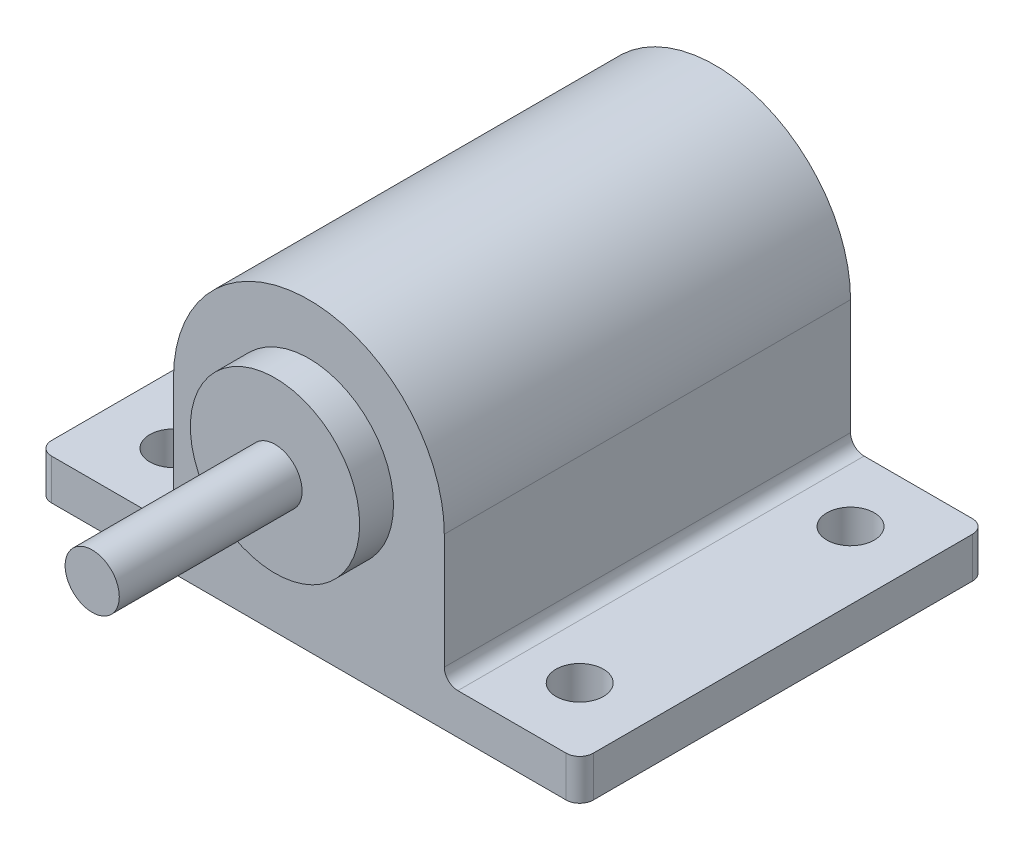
ISO-10303-21;
HEADER;
FILE_DESCRIPTION(('STEP AP214'),'2;1');
FILE_NAME('part.step','',(''),(''),'','','');
FILE_SCHEMA(('AUTOMOTIVE_DESIGN { 1 0 10303 214 1 1 1 1 }'));
ENDSEC;
DATA;
#1=APPLICATION_CONTEXT('core data for automotive mechanical design processes');
#2=APPLICATION_PROTOCOL_DEFINITION('international standard','automotive_design',2000,#1);
#3=PRODUCT_CONTEXT('',#1,'mechanical');
#4=PRODUCT('Part','Part','',(#3));
#5=PRODUCT_RELATED_PRODUCT_CATEGORY('part','',(#4));
#6=PRODUCT_DEFINITION_FORMATION('','',#4);
#7=PRODUCT_DEFINITION_CONTEXT('part definition',#1,'design');
#8=PRODUCT_DEFINITION('design','',#6,#7);
#9=PRODUCT_DEFINITION_SHAPE('','',#8);
#10=(LENGTH_UNIT() NAMED_UNIT(*) SI_UNIT(.MILLI.,.METRE.));
#11=(NAMED_UNIT(*) PLANE_ANGLE_UNIT() SI_UNIT($,.RADIAN.));
#12=(NAMED_UNIT(*) SI_UNIT($,.STERADIAN.) SOLID_ANGLE_UNIT());
#13=UNCERTAINTY_MEASURE_WITH_UNIT(LENGTH_MEASURE(1.E-05),#10,'distance_accuracy_value','');
#14=(GEOMETRIC_REPRESENTATION_CONTEXT(3) GLOBAL_UNCERTAINTY_ASSIGNED_CONTEXT((#13)) GLOBAL_UNIT_ASSIGNED_CONTEXT((#10,
#11,#12)) REPRESENTATION_CONTEXT('',''));
#15=CARTESIAN_POINT('',(0.,0.,0.));
#16=DIRECTION('',(0.,0.,1.));
#17=DIRECTION('',(1.,0.,0.));
#18=AXIS2_PLACEMENT_3D('',#15,#16,#17);
#19=CARTESIAN_POINT('',(-40.,0.,30.));
#20=DIRECTION('',(0.,1.,0.));
#21=DIRECTION('',(0.,0.,1.));
#22=AXIS2_PLACEMENT_3D('',#19,#20,#21);
#23=PLANE('',#22);
#24=CARTESIAN_POINT('',(30.,0.,-20.));
#25=DIRECTION('',(0.,1.,0.));
#26=DIRECTION('',(0.,0.,1.));
#27=AXIS2_PLACEMENT_3D('',#24,#25,#26);
#28=CIRCLE('',#27,3.5);
#29=CARTESIAN_POINT('',(30.,0.,-16.5));
#30=VERTEX_POINT('',#29);
#31=EDGE_CURVE('E180',#30,#30,#28,.T.);
#32=ORIENTED_EDGE('',*,*,#31,.T.);
#33=EDGE_LOOP('',(#32));
#34=FACE_BOUND('',#33,.T.);
#35=CARTESIAN_POINT('',(-30.,0.,20.));
#36=DIRECTION('',(0.,1.,0.));
#37=DIRECTION('',(0.,0.,1.));
#38=AXIS2_PLACEMENT_3D('',#35,#36,#37);
#39=CIRCLE('',#38,3.5);
#40=CARTESIAN_POINT('',(-30.,0.,23.5));
#41=VERTEX_POINT('',#40);
#42=EDGE_CURVE('E175',#41,#41,#39,.T.);
#43=ORIENTED_EDGE('',*,*,#42,.T.);
#44=EDGE_LOOP('',(#43));
#45=FACE_BOUND('',#44,.T.);
#46=DIRECTION('',(0.,0.,1.));
#47=VECTOR('',#46,1.);
#48=CARTESIAN_POINT('',(-40.,0.,-30.));
#49=LINE('',#48,#47);
#50=CARTESIAN_POINT('',(-40.,0.,-28.));
#51=VERTEX_POINT('',#50);
#52=CARTESIAN_POINT('',(-40.,0.,28.));
#53=VERTEX_POINT('',#52);
#54=EDGE_CURVE('E248',#51,#53,#49,.T.);
#55=ORIENTED_EDGE('',*,*,#54,.F.);
#56=CARTESIAN_POINT('',(-38.,0.,-28.));
#57=DIRECTION('',(0.,1.,0.));
#58=DIRECTION('',(0.,0.,1.));
#59=AXIS2_PLACEMENT_3D('',#56,#57,#58);
#60=CIRCLE('',#59,2.);
#61=CARTESIAN_POINT('',(-38.,0.,-30.));
#62=VERTEX_POINT('',#61);
#63=EDGE_CURVE('E211',#51,#62,#60,.F.);
#64=ORIENTED_EDGE('',*,*,#63,.T.);
#65=DIRECTION('',(-1.,0.,0.));
#66=VECTOR('',#65,1.);
#67=CARTESIAN_POINT('',(-40.,0.,-30.));
#68=LINE('',#67,#66);
#69=CARTESIAN_POINT('',(38.,0.,-30.));
#70=VERTEX_POINT('',#69);
#71=EDGE_CURVE('E242',#70,#62,#68,.T.);
#72=ORIENTED_EDGE('',*,*,#71,.F.);
#73=CARTESIAN_POINT('',(38.,0.,-28.));
#74=DIRECTION('',(0.,1.,0.));
#75=DIRECTION('',(0.,0.,1.));
#76=AXIS2_PLACEMENT_3D('',#73,#74,#75);
#77=CIRCLE('',#76,2.);
#78=CARTESIAN_POINT('',(40.,0.,-28.));
#79=VERTEX_POINT('',#78);
#80=EDGE_CURVE('E207',#70,#79,#77,.F.);
#81=ORIENTED_EDGE('',*,*,#80,.T.);
#82=DIRECTION('',(0.,0.,-1.));
#83=VECTOR('',#82,1.);
#84=CARTESIAN_POINT('',(40.,0.,-30.));
#85=LINE('',#84,#83);
#86=CARTESIAN_POINT('',(40.,0.,28.));
#87=VERTEX_POINT('',#86);
#88=EDGE_CURVE('E233',#87,#79,#85,.T.);
#89=ORIENTED_EDGE('',*,*,#88,.F.);
#90=CARTESIAN_POINT('',(38.,0.,28.));
#91=DIRECTION('',(0.,1.,0.));
#92=DIRECTION('',(0.,0.,1.));
#93=AXIS2_PLACEMENT_3D('',#90,#91,#92);
#94=CIRCLE('',#93,2.);
#95=CARTESIAN_POINT('',(38.,0.,30.));
#96=VERTEX_POINT('',#95);
#97=EDGE_CURVE('E205',#87,#96,#94,.F.);
#98=ORIENTED_EDGE('',*,*,#97,.T.);
#99=DIRECTION('',(1.,0.,0.));
#100=VECTOR('',#99,1.);
#101=CARTESIAN_POINT('',(-40.,0.,30.));
#102=LINE('',#101,#100);
#103=CARTESIAN_POINT('',(-38.,0.,30.));
#104=VERTEX_POINT('',#103);
#105=EDGE_CURVE('E243',#104,#96,#102,.T.);
#106=ORIENTED_EDGE('',*,*,#105,.F.);
#107=CARTESIAN_POINT('',(-38.,0.,28.));
#108=DIRECTION('',(0.,1.,0.));
#109=DIRECTION('',(0.,0.,1.));
#110=AXIS2_PLACEMENT_3D('',#107,#108,#109);
#111=CIRCLE('',#110,2.);
#112=EDGE_CURVE('E209',#104,#53,#111,.F.);
#113=ORIENTED_EDGE('',*,*,#112,.T.);
#114=EDGE_LOOP('',(#55,#64,#72,#81,#89,#98,#106,#113));
#115=FACE_BOUND('',#114,.T.);
#116=CARTESIAN_POINT('',(30.,0.,20.));
#117=DIRECTION('',(0.,1.,0.));
#118=DIRECTION('',(0.,0.,1.));
#119=AXIS2_PLACEMENT_3D('',#116,#117,#118);
#120=CIRCLE('',#119,3.5);
#121=CARTESIAN_POINT('',(30.,0.,23.5));
#122=VERTEX_POINT('',#121);
#123=EDGE_CURVE('E176',#122,#122,#120,.T.);
#124=ORIENTED_EDGE('',*,*,#123,.T.);
#125=EDGE_LOOP('',(#124));
#126=FACE_BOUND('',#125,.T.);
#127=CARTESIAN_POINT('',(-30.,0.,-20.));
#128=DIRECTION('',(0.,1.,0.));
#129=DIRECTION('',(0.,0.,1.));
#130=AXIS2_PLACEMENT_3D('',#127,#128,#129);
#131=CIRCLE('',#130,3.5);
#132=CARTESIAN_POINT('',(-30.,0.,-16.5));
#133=VERTEX_POINT('',#132);
#134=EDGE_CURVE('E183',#133,#133,#131,.T.);
#135=ORIENTED_EDGE('',*,*,#134,.T.);
#136=EDGE_LOOP('',(#135));
#137=FACE_BOUND('',#136,.T.);
#138=ADVANCED_FACE('F30',(#34,#45,#115,#126,#137),#23,.F.);
#139=CARTESIAN_POINT('',(-40.,6.,30.));
#140=DIRECTION('',(0.,1.,0.));
#141=DIRECTION('',(0.,0.,1.));
#142=AXIS2_PLACEMENT_3D('',#139,#140,#141);
#143=PLANE('',#142);
#144=CARTESIAN_POINT('',(-30.,6.,20.));
#145=DIRECTION('',(0.,1.,0.));
#146=DIRECTION('',(0.,0.,1.));
#147=AXIS2_PLACEMENT_3D('',#144,#145,#146);
#148=CIRCLE('',#147,3.5);
#149=CARTESIAN_POINT('',(-30.,6.,23.5));
#150=VERTEX_POINT('',#149);
#151=EDGE_CURVE('E512',#150,#150,#148,.F.);
#152=ORIENTED_EDGE('',*,*,#151,.T.);
#153=EDGE_LOOP('',(#152));
#154=FACE_BOUND('',#153,.T.);
#155=DIRECTION('',(-1.,0.,0.));
#156=VECTOR('',#155,1.);
#157=CARTESIAN_POINT('',(-40.,6.,-30.));
#158=LINE('',#157,#156);
#159=CARTESIAN_POINT('',(-22.,6.,-30.));
#160=VERTEX_POINT('',#159);
#161=CARTESIAN_POINT('',(-38.,6.,-30.));
#162=VERTEX_POINT('',#161);
#163=EDGE_CURVE('E528',#160,#162,#158,.T.);
#164=ORIENTED_EDGE('',*,*,#163,.T.);
#165=CARTESIAN_POINT('',(-38.,6.,-28.));
#166=DIRECTION('',(0.,1.,0.));
#167=DIRECTION('',(0.,0.,1.));
#168=AXIS2_PLACEMENT_3D('',#165,#166,#167);
#169=CIRCLE('',#168,2.);
#170=CARTESIAN_POINT('',(-40.,6.,-28.));
#171=VERTEX_POINT('',#170);
#172=EDGE_CURVE('E220',#162,#171,#169,.T.);
#173=ORIENTED_EDGE('',*,*,#172,.T.);
#174=DIRECTION('',(0.,0.,1.));
#175=VECTOR('',#174,1.);
#176=CARTESIAN_POINT('',(-40.,6.,-30.));
#177=LINE('',#176,#175);
#178=CARTESIAN_POINT('',(-40.,6.,28.));
#179=VERTEX_POINT('',#178);
#180=EDGE_CURVE('E246',#171,#179,#177,.T.);
#181=ORIENTED_EDGE('',*,*,#180,.T.);
#182=CARTESIAN_POINT('',(-38.,6.,28.));
#183=DIRECTION('',(0.,1.,0.));
#184=DIRECTION('',(0.,0.,1.));
#185=AXIS2_PLACEMENT_3D('',#182,#183,#184);
#186=CIRCLE('',#185,2.);
#187=CARTESIAN_POINT('',(-38.,6.,30.));
#188=VERTEX_POINT('',#187);
#189=EDGE_CURVE('E218',#179,#188,#186,.T.);
#190=ORIENTED_EDGE('',*,*,#189,.T.);
#191=DIRECTION('',(1.,0.,0.));
#192=VECTOR('',#191,1.);
#193=CARTESIAN_POINT('',(-40.,6.,30.));
#194=LINE('',#193,#192);
#195=CARTESIAN_POINT('',(-22.,6.,30.));
#196=VERTEX_POINT('',#195);
#197=EDGE_CURVE('E525',#188,#196,#194,.T.);
#198=ORIENTED_EDGE('',*,*,#197,.T.);
#199=DIRECTION('',(0.,0.,-1.));
#200=VECTOR('',#199,1.);
#201=CARTESIAN_POINT('',(-22.,6.,30.));
#202=LINE('',#201,#200);
#203=EDGE_CURVE('E156',#196,#160,#202,.T.);
#204=ORIENTED_EDGE('',*,*,#203,.T.);
#205=EDGE_LOOP('',(#164,#173,#181,#190,#198,#204));
#206=FACE_BOUND('',#205,.T.);
#207=CARTESIAN_POINT('',(-30.,6.,-20.));
#208=DIRECTION('',(0.,1.,0.));
#209=DIRECTION('',(0.,0.,1.));
#210=AXIS2_PLACEMENT_3D('',#207,#208,#209);
#211=CIRCLE('',#210,3.5);
#212=CARTESIAN_POINT('',(-30.,6.,-16.5));
#213=VERTEX_POINT('',#212);
#214=EDGE_CURVE('E181',#213,#213,#211,.F.);
#215=ORIENTED_EDGE('',*,*,#214,.T.);
#216=EDGE_LOOP('',(#215));
#217=FACE_BOUND('',#216,.T.);
#218=ADVANCED_FACE('F274',(#154,#206,#217),#143,.T.);
#219=CARTESIAN_POINT('',(30.,6.,20.));
#220=DIRECTION('',(0.,1.,0.));
#221=DIRECTION('',(0.,0.,1.));
#222=AXIS2_PLACEMENT_3D('',#219,#220,#221);
#223=CIRCLE('',#222,3.5);
#224=CARTESIAN_POINT('',(30.,6.,23.5));
#225=VERTEX_POINT('',#224);
#226=EDGE_CURVE('E172',#225,#225,#223,.F.);
#227=ORIENTED_EDGE('',*,*,#226,.T.);
#228=EDGE_LOOP('',(#227));
#229=FACE_BOUND('',#228,.T.);
#230=DIRECTION('',(0.,0.,-1.));
#231=VECTOR('',#230,1.);
#232=CARTESIAN_POINT('',(40.,6.,-30.));
#233=LINE('',#232,#231);
#234=CARTESIAN_POINT('',(40.,6.,28.));
#235=VERTEX_POINT('',#234);
#236=CARTESIAN_POINT('',(40.,6.,-28.));
#237=VERTEX_POINT('',#236);
#238=EDGE_CURVE('E234',#235,#237,#233,.T.);
#239=ORIENTED_EDGE('',*,*,#238,.T.);
#240=CARTESIAN_POINT('',(38.,6.,-28.));
#241=DIRECTION('',(0.,1.,0.));
#242=DIRECTION('',(0.,0.,1.));
#243=AXIS2_PLACEMENT_3D('',#240,#241,#242);
#244=CIRCLE('',#243,2.);
#245=CARTESIAN_POINT('',(38.,6.,-30.));
#246=VERTEX_POINT('',#245);
#247=EDGE_CURVE('E11',#237,#246,#244,.T.);
#248=ORIENTED_EDGE('',*,*,#247,.T.);
#249=CARTESIAN_POINT('',(22.,6.,-30.));
#250=VERTEX_POINT('',#249);
#251=EDGE_CURVE('E253',#246,#250,#158,.T.);
#252=ORIENTED_EDGE('',*,*,#251,.T.);
#253=DIRECTION('',(0.,0.,1.));
#254=VECTOR('',#253,1.);
#255=CARTESIAN_POINT('',(22.,6.,30.));
#256=LINE('',#255,#254);
#257=CARTESIAN_POINT('',(22.,6.,30.));
#258=VERTEX_POINT('',#257);
#259=EDGE_CURVE('E186',#250,#258,#256,.T.);
#260=ORIENTED_EDGE('',*,*,#259,.T.);
#261=CARTESIAN_POINT('',(38.,6.,30.));
#262=VERTEX_POINT('',#261);
#263=EDGE_CURVE('E524',#258,#262,#194,.T.);
#264=ORIENTED_EDGE('',*,*,#263,.T.);
#265=CARTESIAN_POINT('',(38.,6.,28.));
#266=DIRECTION('',(0.,1.,0.));
#267=DIRECTION('',(0.,0.,1.));
#268=AXIS2_PLACEMENT_3D('',#265,#266,#267);
#269=CIRCLE('',#268,2.);
#270=EDGE_CURVE('E38',#262,#235,#269,.T.);
#271=ORIENTED_EDGE('',*,*,#270,.T.);
#272=EDGE_LOOP('',(#239,#248,#252,#260,#264,#271));
#273=FACE_BOUND('',#272,.T.);
#274=CARTESIAN_POINT('',(30.,6.,-20.));
#275=DIRECTION('',(0.,1.,0.));
#276=DIRECTION('',(0.,0.,1.));
#277=AXIS2_PLACEMENT_3D('',#274,#275,#276);
#278=CIRCLE('',#277,3.5);
#279=CARTESIAN_POINT('',(30.,6.,-16.5));
#280=VERTEX_POINT('',#279);
#281=EDGE_CURVE('E177',#280,#280,#278,.F.);
#282=ORIENTED_EDGE('',*,*,#281,.T.);
#283=EDGE_LOOP('',(#282));
#284=FACE_BOUND('',#283,.T.);
#285=ADVANCED_FACE('F280',(#229,#273,#284),#143,.T.);
#286=CARTESIAN_POINT('',(0.,25.,30.));
#287=DIRECTION('',(0.,0.,-1.));
#288=DIRECTION('',(-1.,0.,0.));
#289=AXIS2_PLACEMENT_3D('',#286,#287,#288);
#290=CYLINDRICAL_SURFACE('',#289,20.);
#291=DIRECTION('',(0.,0.,-1.));
#292=VECTOR('',#291,1.);
#293=CARTESIAN_POINT('',(-20.,25.,30.));
#294=LINE('',#293,#292);
#295=CARTESIAN_POINT('',(-20.,25.,-30.));
#296=VERTEX_POINT('',#295);
#297=CARTESIAN_POINT('',(-20.,25.,30.));
#298=VERTEX_POINT('',#297);
#299=EDGE_CURVE('E144',#296,#298,#294,.F.);
#300=ORIENTED_EDGE('',*,*,#299,.T.);
#301=CARTESIAN_POINT('',(0.,25.,30.));
#302=DIRECTION('',(0.,0.,1.));
#303=DIRECTION('',(1.,0.,0.));
#304=AXIS2_PLACEMENT_3D('',#301,#302,#303);
#305=CIRCLE('',#304,20.);
#306=CARTESIAN_POINT('',(20.,25.,30.));
#307=VERTEX_POINT('',#306);
#308=EDGE_CURVE('E138',#307,#298,#305,.T.);
#309=ORIENTED_EDGE('',*,*,#308,.F.);
#310=DIRECTION('',(0.,0.,-1.));
#311=VECTOR('',#310,1.);
#312=CARTESIAN_POINT('',(20.,25.,30.));
#313=LINE('',#312,#311);
#314=CARTESIAN_POINT('',(20.,25.,-30.));
#315=VERTEX_POINT('',#314);
#316=EDGE_CURVE('E145',#315,#307,#313,.F.);
#317=ORIENTED_EDGE('',*,*,#316,.F.);
#318=CARTESIAN_POINT('',(0.,25.,-30.));
#319=DIRECTION('',(0.,0.,1.));
#320=DIRECTION('',(1.,0.,0.));
#321=AXIS2_PLACEMENT_3D('',#318,#319,#320);
#322=CIRCLE('',#321,20.);
#323=EDGE_CURVE('E157',#315,#296,#322,.T.);
#324=ORIENTED_EDGE('',*,*,#323,.T.);
#325=EDGE_LOOP('',(#300,#309,#317,#324));
#326=FACE_BOUND('',#325,.T.);
#327=ADVANCED_FACE('F154',(#326),#290,.T.);
#328=CARTESIAN_POINT('',(0.,25.,35.));
#329=DIRECTION('',(0.,0.,1.));
#330=DIRECTION('',(1.,0.,0.));
#331=AXIS2_PLACEMENT_3D('',#328,#329,#330);
#332=PLANE('',#331);
#333=CARTESIAN_POINT('',(0.,25.,35.));
#334=DIRECTION('',(0.,0.,1.));
#335=DIRECTION('',(1.,0.,0.));
#336=AXIS2_PLACEMENT_3D('',#333,#334,#335);
#337=CIRCLE('',#336,12.5);
#338=CARTESIAN_POINT('',(12.5,25.,35.));
#339=VERTEX_POINT('',#338);
#340=EDGE_CURVE('E162',#339,#339,#337,.T.);
#341=ORIENTED_EDGE('',*,*,#340,.T.);
#342=EDGE_LOOP('',(#341));
#343=FACE_BOUND('',#342,.T.);
#344=CARTESIAN_POINT('',(0.,25.,35.));
#345=DIRECTION('',(0.,0.,1.));
#346=DIRECTION('',(1.,0.,0.));
#347=AXIS2_PLACEMENT_3D('',#344,#345,#346);
#348=CIRCLE('',#347,4.);
#349=CARTESIAN_POINT('',(4.,25.,35.));
#350=VERTEX_POINT('',#349);
#351=EDGE_CURVE('E168',#350,#350,#348,.F.);
#352=ORIENTED_EDGE('',*,*,#351,.T.);
#353=EDGE_LOOP('',(#352));
#354=FACE_BOUND('',#353,.T.);
#355=ADVANCED_FACE('F263',(#343,#354),#332,.T.);
#356=CARTESIAN_POINT('',(0.,25.,30.));
#357=DIRECTION('',(0.,0.,1.));
#358=DIRECTION('',(1.,0.,0.));
#359=AXIS2_PLACEMENT_3D('',#356,#357,#358);
#360=PLANE('',#359);
#361=ORIENTED_EDGE('',*,*,#197,.F.);
#362=DIRECTION('',(0.,-1.,0.));
#363=VECTOR('',#362,1.);
#364=CARTESIAN_POINT('',(-38.,0.,30.));
#365=LINE('',#364,#363);
#366=EDGE_CURVE('E224',#188,#104,#365,.T.);
#367=ORIENTED_EDGE('',*,*,#366,.T.);
#368=ORIENTED_EDGE('',*,*,#105,.T.);
#369=DIRECTION('',(0.,-1.,0.));
#370=VECTOR('',#369,1.);
#371=CARTESIAN_POINT('',(38.,6.,30.));
#372=LINE('',#371,#370);
#373=EDGE_CURVE('E222',#96,#262,#372,.F.);
#374=ORIENTED_EDGE('',*,*,#373,.T.);
#375=ORIENTED_EDGE('',*,*,#263,.F.);
#376=CARTESIAN_POINT('',(22.,8.,30.));
#377=DIRECTION('',(0.,0.,1.));
#378=DIRECTION('',(1.,0.,0.));
#379=AXIS2_PLACEMENT_3D('',#376,#377,#378);
#380=CIRCLE('',#379,2.);
#381=CARTESIAN_POINT('',(20.,8.,30.));
#382=VERTEX_POINT('',#381);
#383=EDGE_CURVE('E141',#258,#382,#380,.F.);
#384=ORIENTED_EDGE('',*,*,#383,.T.);
#385=DIRECTION('',(0.,-1.,0.));
#386=VECTOR('',#385,1.);
#387=CARTESIAN_POINT('',(20.,45.001,30.));
#388=LINE('',#387,#386);
#389=EDGE_CURVE('E131',#307,#382,#388,.T.);
#390=ORIENTED_EDGE('',*,*,#389,.F.);
#391=ORIENTED_EDGE('',*,*,#308,.T.);
#392=DIRECTION('',(0.,-1.,0.));
#393=VECTOR('',#392,1.);
#394=CARTESIAN_POINT('',(-20.,45.001,30.));
#395=LINE('',#394,#393);
#396=CARTESIAN_POINT('',(-20.,8.,30.));
#397=VERTEX_POINT('',#396);
#398=EDGE_CURVE('E516',#298,#397,#395,.T.);
#399=ORIENTED_EDGE('',*,*,#398,.T.);
#400=CARTESIAN_POINT('',(-22.,8.,30.));
#401=DIRECTION('',(0.,0.,1.));
#402=DIRECTION('',(1.,0.,0.));
#403=AXIS2_PLACEMENT_3D('',#400,#401,#402);
#404=CIRCLE('',#403,2.);
#405=EDGE_CURVE('E193',#397,#196,#404,.F.);
#406=ORIENTED_EDGE('',*,*,#405,.T.);
#407=EDGE_LOOP('',(#361,#367,#368,#374,#375,#384,#390,#391,#399,#406));
#408=FACE_BOUND('',#407,.T.);
#409=CARTESIAN_POINT('',(0.,25.,30.));
#410=DIRECTION('',(0.,0.,1.));
#411=DIRECTION('',(1.,0.,0.));
#412=AXIS2_PLACEMENT_3D('',#409,#410,#411);
#413=CIRCLE('',#412,12.5);
#414=CARTESIAN_POINT('',(12.5,25.,30.));
#415=VERTEX_POINT('',#414);
#416=EDGE_CURVE('E165',#415,#415,#413,.T.);
#417=ORIENTED_EDGE('',*,*,#416,.F.);
#418=EDGE_LOOP('',(#417));
#419=FACE_BOUND('',#418,.T.);
#420=ADVANCED_FACE('F134',(#408,#419),#360,.T.);
#421=CARTESIAN_POINT('',(0.,25.,-30.));
#422=DIRECTION('',(0.,0.,1.));
#423=DIRECTION('',(1.,0.,0.));
#424=AXIS2_PLACEMENT_3D('',#421,#422,#423);
#425=PLANE('',#424);
#426=ORIENTED_EDGE('',*,*,#71,.T.);
#427=DIRECTION('',(0.,-1.,0.));
#428=VECTOR('',#427,1.);
#429=CARTESIAN_POINT('',(-38.,25.,-30.));
#430=LINE('',#429,#428);
#431=EDGE_CURVE('E216',#62,#162,#430,.F.);
#432=ORIENTED_EDGE('',*,*,#431,.T.);
#433=ORIENTED_EDGE('',*,*,#163,.F.);
#434=CARTESIAN_POINT('',(-22.,8.,-30.));
#435=DIRECTION('',(0.,0.,1.));
#436=DIRECTION('',(1.,0.,0.));
#437=AXIS2_PLACEMENT_3D('',#434,#435,#436);
#438=CIRCLE('',#437,2.);
#439=CARTESIAN_POINT('',(-20.,8.,-30.));
#440=VERTEX_POINT('',#439);
#441=EDGE_CURVE('E191',#160,#440,#438,.T.);
#442=ORIENTED_EDGE('',*,*,#441,.T.);
#443=DIRECTION('',(0.,-1.,0.));
#444=VECTOR('',#443,1.);
#445=CARTESIAN_POINT('',(-20.,45.001,-30.));
#446=LINE('',#445,#444);
#447=EDGE_CURVE('E515',#296,#440,#446,.T.);
#448=ORIENTED_EDGE('',*,*,#447,.F.);
#449=ORIENTED_EDGE('',*,*,#323,.F.);
#450=DIRECTION('',(0.,-1.,0.));
#451=VECTOR('',#450,1.);
#452=CARTESIAN_POINT('',(20.,45.001,-30.));
#453=LINE('',#452,#451);
#454=CARTESIAN_POINT('',(20.,8.,-30.));
#455=VERTEX_POINT('',#454);
#456=EDGE_CURVE('E150',#315,#455,#453,.T.);
#457=ORIENTED_EDGE('',*,*,#456,.T.);
#458=CARTESIAN_POINT('',(22.,8.,-30.));
#459=DIRECTION('',(0.,0.,1.));
#460=DIRECTION('',(1.,0.,0.));
#461=AXIS2_PLACEMENT_3D('',#458,#459,#460);
#462=CIRCLE('',#461,2.);
#463=EDGE_CURVE('E197',#455,#250,#462,.T.);
#464=ORIENTED_EDGE('',*,*,#463,.T.);
#465=ORIENTED_EDGE('',*,*,#251,.F.);
#466=DIRECTION('',(0.,-1.,0.));
#467=VECTOR('',#466,1.);
#468=CARTESIAN_POINT('',(38.,25.,-30.));
#469=LINE('',#468,#467);
#470=EDGE_CURVE('E213',#246,#70,#469,.T.);
#471=ORIENTED_EDGE('',*,*,#470,.T.);
#472=EDGE_LOOP('',(#426,#432,#433,#442,#448,#449,#457,#464,#465,#471));
#473=FACE_BOUND('',#472,.T.);
#474=ADVANCED_FACE('F262',(#473),#425,.F.);
#475=CARTESIAN_POINT('',(0.,25.,35.));
#476=DIRECTION('',(0.,0.,-1.));
#477=DIRECTION('',(-1.,0.,0.));
#478=AXIS2_PLACEMENT_3D('',#475,#476,#477);
#479=CYLINDRICAL_SURFACE('',#478,12.5);
#480=ORIENTED_EDGE('',*,*,#340,.F.);
#481=EDGE_LOOP('',(#480));
#482=FACE_BOUND('',#481,.T.);
#483=ORIENTED_EDGE('',*,*,#416,.T.);
#484=EDGE_LOOP('',(#483));
#485=FACE_BOUND('',#484,.T.);
#486=ADVANCED_FACE('F260',(#482,#485),#479,.T.);
#487=CARTESIAN_POINT('',(0.,25.,62.));
#488=DIRECTION('',(0.,0.,-1.));
#489=DIRECTION('',(-1.,0.,0.));
#490=AXIS2_PLACEMENT_3D('',#487,#488,#489);
#491=CYLINDRICAL_SURFACE('',#490,4.);
#492=ORIENTED_EDGE('',*,*,#351,.F.);
#493=EDGE_LOOP('',(#492));
#494=FACE_BOUND('',#493,.T.);
#495=CARTESIAN_POINT('',(0.,25.,62.));
#496=DIRECTION('',(0.,0.,1.));
#497=DIRECTION('',(1.,0.,0.));
#498=AXIS2_PLACEMENT_3D('',#495,#496,#497);
#499=CIRCLE('',#498,4.);
#500=CARTESIAN_POINT('',(4.,25.,62.));
#501=VERTEX_POINT('',#500);
#502=EDGE_CURVE('E171',#501,#501,#499,.T.);
#503=ORIENTED_EDGE('',*,*,#502,.F.);
#504=EDGE_LOOP('',(#503));
#505=FACE_BOUND('',#504,.T.);
#506=ADVANCED_FACE('F297',(#494,#505),#491,.T.);
#507=CARTESIAN_POINT('',(0.,25.,62.));
#508=DIRECTION('',(0.,0.,1.));
#509=DIRECTION('',(1.,0.,0.));
#510=AXIS2_PLACEMENT_3D('',#507,#508,#509);
#511=PLANE('',#510);
#512=ORIENTED_EDGE('',*,*,#502,.T.);
#513=EDGE_LOOP('',(#512));
#514=FACE_BOUND('',#513,.T.);
#515=ADVANCED_FACE('F293',(#514),#511,.T.);
#516=CARTESIAN_POINT('',(-40.,6.,-30.));
#517=DIRECTION('',(1.,0.,0.));
#518=DIRECTION('',(0.,0.,-1.));
#519=AXIS2_PLACEMENT_3D('',#516,#517,#518);
#520=PLANE('',#519);
#521=ORIENTED_EDGE('',*,*,#180,.F.);
#522=DIRECTION('',(0.,-1.,0.));
#523=VECTOR('',#522,1.);
#524=CARTESIAN_POINT('',(-40.,6.,-28.));
#525=LINE('',#524,#523);
#526=EDGE_CURVE('E202',#171,#51,#525,.T.);
#527=ORIENTED_EDGE('',*,*,#526,.T.);
#528=ORIENTED_EDGE('',*,*,#54,.T.);
#529=DIRECTION('',(0.,-1.,0.));
#530=VECTOR('',#529,1.);
#531=CARTESIAN_POINT('',(-40.,6.,28.));
#532=LINE('',#531,#530);
#533=EDGE_CURVE('E200',#53,#179,#532,.F.);
#534=ORIENTED_EDGE('',*,*,#533,.T.);
#535=EDGE_LOOP('',(#521,#527,#528,#534));
#536=FACE_BOUND('',#535,.T.);
#537=ADVANCED_FACE('F290',(#536),#520,.F.);
#538=CARTESIAN_POINT('',(40.,6.,-30.));
#539=DIRECTION('',(-1.,0.,0.));
#540=DIRECTION('',(0.,0.,1.));
#541=AXIS2_PLACEMENT_3D('',#538,#539,#540);
#542=PLANE('',#541);
#543=ORIENTED_EDGE('',*,*,#88,.T.);
#544=DIRECTION('',(0.,-1.,0.));
#545=VECTOR('',#544,1.);
#546=CARTESIAN_POINT('',(40.,6.,-28.));
#547=LINE('',#546,#545);
#548=EDGE_CURVE('E45',#79,#237,#547,.F.);
#549=ORIENTED_EDGE('',*,*,#548,.T.);
#550=ORIENTED_EDGE('',*,*,#238,.F.);
#551=DIRECTION('',(0.,-1.,0.));
#552=VECTOR('',#551,1.);
#553=CARTESIAN_POINT('',(40.,0.,28.));
#554=LINE('',#553,#552);
#555=EDGE_CURVE('E227',#235,#87,#554,.T.);
#556=ORIENTED_EDGE('',*,*,#555,.T.);
#557=EDGE_LOOP('',(#543,#549,#550,#556));
#558=FACE_BOUND('',#557,.T.);
#559=ADVANCED_FACE('F232',(#558),#542,.F.);
#560=CARTESIAN_POINT('',(-20.,45.001,-30.));
#561=DIRECTION('',(1.,0.,0.));
#562=DIRECTION('',(0.,0.,-1.));
#563=AXIS2_PLACEMENT_3D('',#560,#561,#562);
#564=PLANE('',#563);
#565=ORIENTED_EDGE('',*,*,#447,.T.);
#566=DIRECTION('',(0.,0.,-1.));
#567=VECTOR('',#566,1.);
#568=CARTESIAN_POINT('',(-20.,8.,-30.));
#569=LINE('',#568,#567);
#570=EDGE_CURVE('E160',#440,#397,#569,.F.);
#571=ORIENTED_EDGE('',*,*,#570,.T.);
#572=ORIENTED_EDGE('',*,*,#398,.F.);
#573=ORIENTED_EDGE('',*,*,#299,.F.);
#574=EDGE_LOOP('',(#565,#571,#572,#573));
#575=FACE_BOUND('',#574,.T.);
#576=ADVANCED_FACE('F289',(#575),#564,.F.);
#577=CARTESIAN_POINT('',(20.,45.001,-30.));
#578=DIRECTION('',(-1.,0.,0.));
#579=DIRECTION('',(0.,0.,1.));
#580=AXIS2_PLACEMENT_3D('',#577,#578,#579);
#581=PLANE('',#580);
#582=ORIENTED_EDGE('',*,*,#389,.T.);
#583=DIRECTION('',(0.,0.,1.));
#584=VECTOR('',#583,1.);
#585=CARTESIAN_POINT('',(20.,8.,-30.));
#586=LINE('',#585,#584);
#587=EDGE_CURVE('E189',#382,#455,#586,.F.);
#588=ORIENTED_EDGE('',*,*,#587,.T.);
#589=ORIENTED_EDGE('',*,*,#456,.F.);
#590=ORIENTED_EDGE('',*,*,#316,.T.);
#591=EDGE_LOOP('',(#582,#588,#589,#590));
#592=FACE_BOUND('',#591,.T.);
#593=ADVANCED_FACE('F148',(#592),#581,.F.);
#594=CARTESIAN_POINT('',(-30.,45.,20.));
#595=DIRECTION('',(0.,-1.,0.));
#596=DIRECTION('',(0.,0.,-1.));
#597=AXIS2_PLACEMENT_3D('',#594,#595,#596);
#598=CYLINDRICAL_SURFACE('',#597,3.5);
#599=ORIENTED_EDGE('',*,*,#151,.F.);
#600=EDGE_LOOP('',(#599));
#601=FACE_BOUND('',#600,.T.);
#602=ORIENTED_EDGE('',*,*,#42,.F.);
#603=EDGE_LOOP('',(#602));
#604=FACE_BOUND('',#603,.T.);
#605=ADVANCED_FACE('F339',(#601,#604),#598,.F.);
#606=CARTESIAN_POINT('',(30.,45.,20.));
#607=DIRECTION('',(0.,-1.,0.));
#608=DIRECTION('',(0.,0.,-1.));
#609=AXIS2_PLACEMENT_3D('',#606,#607,#608);
#610=CYLINDRICAL_SURFACE('',#609,3.5);
#611=ORIENTED_EDGE('',*,*,#226,.F.);
#612=EDGE_LOOP('',(#611));
#613=FACE_BOUND('',#612,.T.);
#614=ORIENTED_EDGE('',*,*,#123,.F.);
#615=EDGE_LOOP('',(#614));
#616=FACE_BOUND('',#615,.T.);
#617=ADVANCED_FACE('F347',(#613,#616),#610,.F.);
#618=CARTESIAN_POINT('',(30.,45.,-20.));
#619=DIRECTION('',(0.,-1.,0.));
#620=DIRECTION('',(0.,0.,-1.));
#621=AXIS2_PLACEMENT_3D('',#618,#619,#620);
#622=CYLINDRICAL_SURFACE('',#621,3.5);
#623=ORIENTED_EDGE('',*,*,#281,.F.);
#624=EDGE_LOOP('',(#623));
#625=FACE_BOUND('',#624,.T.);
#626=ORIENTED_EDGE('',*,*,#31,.F.);
#627=EDGE_LOOP('',(#626));
#628=FACE_BOUND('',#627,.T.);
#629=ADVANCED_FACE('F355',(#625,#628),#622,.F.);
#630=CARTESIAN_POINT('',(-30.,45.,-20.));
#631=DIRECTION('',(0.,-1.,0.));
#632=DIRECTION('',(0.,0.,-1.));
#633=AXIS2_PLACEMENT_3D('',#630,#631,#632);
#634=CYLINDRICAL_SURFACE('',#633,3.5);
#635=ORIENTED_EDGE('',*,*,#214,.F.);
#636=EDGE_LOOP('',(#635));
#637=FACE_BOUND('',#636,.T.);
#638=ORIENTED_EDGE('',*,*,#134,.F.);
#639=EDGE_LOOP('',(#638));
#640=FACE_BOUND('',#639,.T.);
#641=ADVANCED_FACE('F363',(#637,#640),#634,.F.);
#642=CARTESIAN_POINT('',(-22.,8.,30.));
#643=DIRECTION('',(0.,0.,-1.));
#644=DIRECTION('',(-1.,0.,0.));
#645=AXIS2_PLACEMENT_3D('',#642,#643,#644);
#646=CYLINDRICAL_SURFACE('',#645,2.);
#647=ORIENTED_EDGE('',*,*,#405,.F.);
#648=ORIENTED_EDGE('',*,*,#570,.F.);
#649=ORIENTED_EDGE('',*,*,#441,.F.);
#650=ORIENTED_EDGE('',*,*,#203,.F.);
#651=EDGE_LOOP('',(#647,#648,#649,#650));
#652=FACE_BOUND('',#651,.T.);
#653=ADVANCED_FACE('F370',(#652),#646,.F.);
#654=CARTESIAN_POINT('',(22.,8.,30.));
#655=DIRECTION('',(0.,0.,1.));
#656=DIRECTION('',(1.,0.,0.));
#657=AXIS2_PLACEMENT_3D('',#654,#655,#656);
#658=CYLINDRICAL_SURFACE('',#657,2.);
#659=ORIENTED_EDGE('',*,*,#463,.F.);
#660=ORIENTED_EDGE('',*,*,#587,.F.);
#661=ORIENTED_EDGE('',*,*,#383,.F.);
#662=ORIENTED_EDGE('',*,*,#259,.F.);
#663=EDGE_LOOP('',(#659,#660,#661,#662));
#664=FACE_BOUND('',#663,.T.);
#665=ADVANCED_FACE('F377',(#664),#658,.F.);
#666=CARTESIAN_POINT('',(-38.,6.,-28.));
#667=DIRECTION('',(0.,-1.,0.));
#668=DIRECTION('',(0.,0.,-1.));
#669=AXIS2_PLACEMENT_3D('',#666,#667,#668);
#670=CYLINDRICAL_SURFACE('',#669,2.);
#671=ORIENTED_EDGE('',*,*,#172,.F.);
#672=ORIENTED_EDGE('',*,*,#431,.F.);
#673=ORIENTED_EDGE('',*,*,#63,.F.);
#674=ORIENTED_EDGE('',*,*,#526,.F.);
#675=EDGE_LOOP('',(#671,#672,#673,#674));
#676=FACE_BOUND('',#675,.T.);
#677=ADVANCED_FACE('F385',(#676),#670,.T.);
#678=CARTESIAN_POINT('',(-38.,25.,28.));
#679=DIRECTION('',(0.,1.,0.));
#680=DIRECTION('',(0.,0.,1.));
#681=AXIS2_PLACEMENT_3D('',#678,#679,#680);
#682=CYLINDRICAL_SURFACE('',#681,2.);
#683=ORIENTED_EDGE('',*,*,#189,.F.);
#684=ORIENTED_EDGE('',*,*,#533,.F.);
#685=ORIENTED_EDGE('',*,*,#112,.F.);
#686=ORIENTED_EDGE('',*,*,#366,.F.);
#687=EDGE_LOOP('',(#683,#684,#685,#686));
#688=FACE_BOUND('',#687,.T.);
#689=ADVANCED_FACE('F392',(#688),#682,.T.);
#690=CARTESIAN_POINT('',(38.,25.,-28.));
#691=DIRECTION('',(0.,-1.,0.));
#692=DIRECTION('',(0.,0.,-1.));
#693=AXIS2_PLACEMENT_3D('',#690,#691,#692);
#694=CYLINDRICAL_SURFACE('',#693,2.);
#695=ORIENTED_EDGE('',*,*,#247,.F.);
#696=ORIENTED_EDGE('',*,*,#548,.F.);
#697=ORIENTED_EDGE('',*,*,#80,.F.);
#698=ORIENTED_EDGE('',*,*,#470,.F.);
#699=EDGE_LOOP('',(#695,#696,#697,#698));
#700=FACE_BOUND('',#699,.T.);
#701=ADVANCED_FACE('F400',(#700),#694,.T.);
#702=CARTESIAN_POINT('',(38.,6.,28.));
#703=DIRECTION('',(0.,1.,0.));
#704=DIRECTION('',(0.,0.,1.));
#705=AXIS2_PLACEMENT_3D('',#702,#703,#704);
#706=CYLINDRICAL_SURFACE('',#705,2.);
#707=ORIENTED_EDGE('',*,*,#270,.F.);
#708=ORIENTED_EDGE('',*,*,#373,.F.);
#709=ORIENTED_EDGE('',*,*,#97,.F.);
#710=ORIENTED_EDGE('',*,*,#555,.F.);
#711=EDGE_LOOP('',(#707,#708,#709,#710));
#712=FACE_BOUND('',#711,.T.);
#713=ADVANCED_FACE('F32',(#712),#706,.T.);
#714=CLOSED_SHELL('',(#138,#218,#285,#327,#355,#420,#474,#486,#506,#515,#537,#559,#576,#593,
#605,#617,#629,#641,#653,#665,#677,#689,#701,#713));
#715=MANIFOLD_SOLID_BREP('B2',#714);
#716=ADVANCED_BREP_SHAPE_REPRESENTATION('',(#18,#715),#14);
#717=SHAPE_DEFINITION_REPRESENTATION(#9,#716);
ENDSEC;
END-ISO-10303-21;
